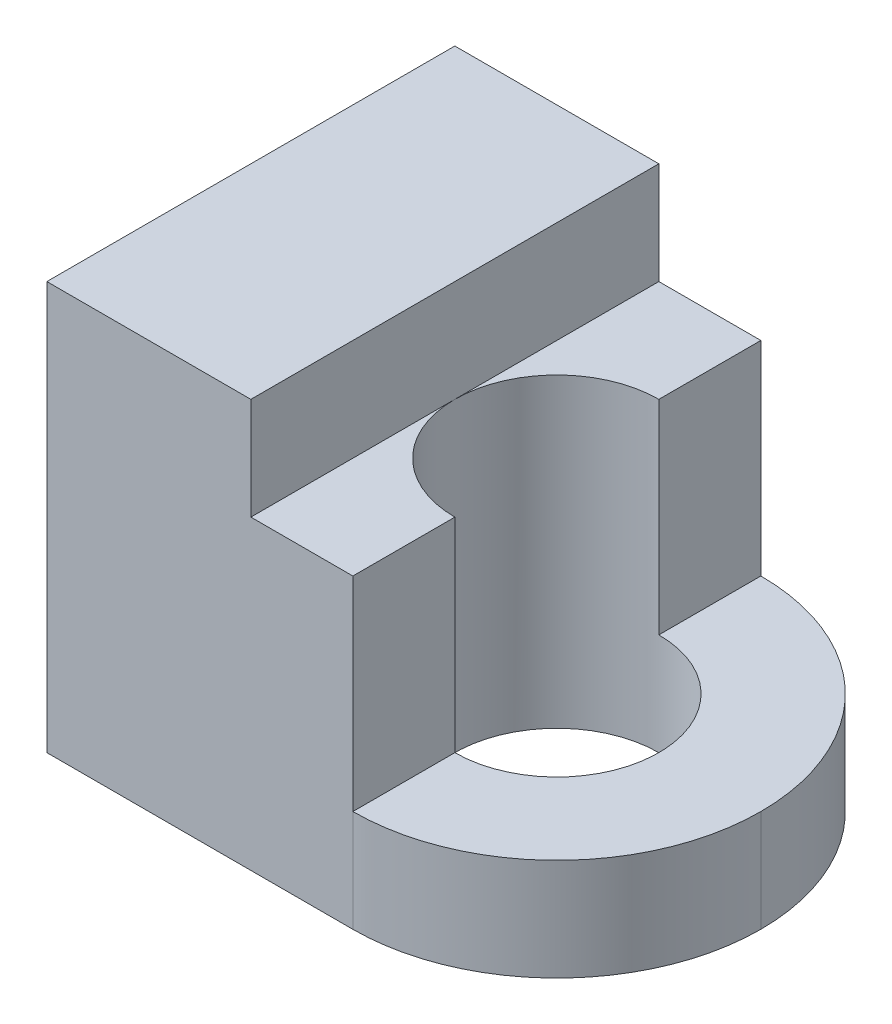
ISO-10303-21;
HEADER;
FILE_DESCRIPTION(('STEP AP214'),'2;1');
FILE_NAME('part.step','',(''),(''),'','','');
FILE_SCHEMA(('AUTOMOTIVE_DESIGN { 1 0 10303 214 1 1 1 1 }'));
ENDSEC;
DATA;
#1=APPLICATION_CONTEXT('core data for automotive mechanical design processes');
#2=APPLICATION_PROTOCOL_DEFINITION('international standard','automotive_design',2000,#1);
#3=PRODUCT_CONTEXT('',#1,'mechanical');
#4=PRODUCT('Part','Part','',(#3));
#5=PRODUCT_RELATED_PRODUCT_CATEGORY('part','',(#4));
#6=PRODUCT_DEFINITION_FORMATION('','',#4);
#7=PRODUCT_DEFINITION_CONTEXT('part definition',#1,'design');
#8=PRODUCT_DEFINITION('design','',#6,#7);
#9=PRODUCT_DEFINITION_SHAPE('','',#8);
#10=(LENGTH_UNIT() NAMED_UNIT(*) SI_UNIT(.MILLI.,.METRE.));
#11=(NAMED_UNIT(*) PLANE_ANGLE_UNIT() SI_UNIT($,.RADIAN.));
#12=(NAMED_UNIT(*) SI_UNIT($,.STERADIAN.) SOLID_ANGLE_UNIT());
#13=UNCERTAINTY_MEASURE_WITH_UNIT(LENGTH_MEASURE(1.E-05),#10,'distance_accuracy_value','');
#14=(GEOMETRIC_REPRESENTATION_CONTEXT(3) GLOBAL_UNCERTAINTY_ASSIGNED_CONTEXT((#13)) GLOBAL_UNIT_ASSIGNED_CONTEXT((#10,
#11,#12)) REPRESENTATION_CONTEXT('',''));
#15=CARTESIAN_POINT('',(0.,0.,0.));
#16=DIRECTION('',(0.,0.,1.));
#17=DIRECTION('',(1.,0.,0.));
#18=AXIS2_PLACEMENT_3D('',#15,#16,#17);
#19=CARTESIAN_POINT('',(30.,30.,0.));
#20=DIRECTION('',(1.,0.,0.));
#21=DIRECTION('',(0.,0.,-1.));
#22=AXIS2_PLACEMENT_3D('',#19,#20,#21);
#23=PLANE('',#22);
#24=DIRECTION('',(0.,-1.,0.));
#25=VECTOR('',#24,1.);
#26=CARTESIAN_POINT('',(30.,40.000025,10.));
#27=LINE('',#26,#25);
#28=CARTESIAN_POINT('',(30.,30.,10.));
#29=VERTEX_POINT('',#28);
#30=CARTESIAN_POINT('',(30.,10.,10.));
#31=VERTEX_POINT('',#30);
#32=EDGE_CURVE('E114',#29,#31,#27,.T.);
#33=ORIENTED_EDGE('',*,*,#32,.F.);
#34=DIRECTION('',(0.,0.,1.));
#35=VECTOR('',#34,1.);
#36=CARTESIAN_POINT('',(30.,30.,0.));
#37=LINE('',#36,#35);
#38=CARTESIAN_POINT('',(30.,30.,20.));
#39=VERTEX_POINT('',#38);
#40=EDGE_CURVE('E124',#29,#39,#37,.T.);
#41=ORIENTED_EDGE('',*,*,#40,.T.);
#42=DIRECTION('',(0.,-1.,0.));
#43=VECTOR('',#42,1.);
#44=CARTESIAN_POINT('',(30.,30.,20.));
#45=LINE('',#44,#43);
#46=CARTESIAN_POINT('',(30.,10.,20.));
#47=VERTEX_POINT('',#46);
#48=EDGE_CURVE('E148',#39,#47,#45,.T.);
#49=ORIENTED_EDGE('',*,*,#48,.T.);
#50=DIRECTION('',(0.,0.,1.));
#51=VECTOR('',#50,1.);
#52=CARTESIAN_POINT('',(30.,10.,0.));
#53=LINE('',#52,#51);
#54=EDGE_CURVE('E34',#31,#47,#53,.T.);
#55=ORIENTED_EDGE('',*,*,#54,.F.);
#56=EDGE_LOOP('',(#33,#41,#49,#55));
#57=FACE_BOUND('',#56,.T.);
#58=ADVANCED_FACE('F30',(#57),#23,.T.);
#59=CARTESIAN_POINT('',(-24.9460396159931,30.,0.));
#60=DIRECTION('',(0.,1.,0.));
#61=DIRECTION('',(0.,0.,1.));
#62=AXIS2_PLACEMENT_3D('',#59,#60,#61);
#63=PLANE('',#62);
#64=CARTESIAN_POINT('',(30.,30.,0.));
#65=DIRECTION('',(0.,1.,0.));
#66=DIRECTION('',(0.,0.,1.));
#67=AXIS2_PLACEMENT_3D('',#64,#65,#66);
#68=CIRCLE('',#67,10.);
#69=CARTESIAN_POINT('',(30.,30.,-10.));
#70=VERTEX_POINT('',#69);
#71=CARTESIAN_POINT('',(20.,30.,0.));
#72=VERTEX_POINT('',#71);
#73=EDGE_CURVE('E48',#70,#72,#68,.T.);
#74=ORIENTED_EDGE('',*,*,#73,.F.);
#75=CARTESIAN_POINT('',(30.,30.,-20.));
#76=VERTEX_POINT('',#75);
#77=EDGE_CURVE('E132',#76,#70,#37,.T.);
#78=ORIENTED_EDGE('',*,*,#77,.F.);
#79=DIRECTION('',(1.,0.,0.));
#80=VECTOR('',#79,1.);
#81=CARTESIAN_POINT('',(-24.9460396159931,30.,-20.));
#82=LINE('',#81,#80);
#83=CARTESIAN_POINT('',(20.,30.,-20.));
#84=VERTEX_POINT('',#83);
#85=EDGE_CURVE('E165',#84,#76,#82,.T.);
#86=ORIENTED_EDGE('',*,*,#85,.F.);
#87=DIRECTION('',(0.,0.,1.));
#88=VECTOR('',#87,1.);
#89=CARTESIAN_POINT('',(20.,30.,0.));
#90=LINE('',#89,#88);
#91=EDGE_CURVE('E136',#84,#72,#90,.T.);
#92=ORIENTED_EDGE('',*,*,#91,.T.);
#93=EDGE_LOOP('',(#74,#78,#86,#92));
#94=FACE_BOUND('',#93,.T.);
#95=ADVANCED_FACE('F225',(#94),#63,.T.);
#96=CARTESIAN_POINT('',(-24.9460396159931,10.,-20.));
#97=DIRECTION('',(0.,0.,-1.));
#98=DIRECTION('',(-1.,0.,0.));
#99=AXIS2_PLACEMENT_3D('',#96,#97,#98);
#100=PLANE('',#99);
#101=DIRECTION('',(0.,-1.,0.));
#102=VECTOR('',#101,1.);
#103=CARTESIAN_POINT('',(30.,30.,-20.));
#104=LINE('',#103,#102);
#105=CARTESIAN_POINT('',(30.,10.,-20.));
#106=VERTEX_POINT('',#105);
#107=EDGE_CURVE('E135',#76,#106,#104,.T.);
#108=ORIENTED_EDGE('',*,*,#107,.T.);
#109=DIRECTION('',(0.,-1.,0.));
#110=VECTOR('',#109,1.);
#111=CARTESIAN_POINT('',(30.,10.,-20.));
#112=LINE('',#111,#110);
#113=CARTESIAN_POINT('',(30.,0.,-20.));
#114=VERTEX_POINT('',#113);
#115=EDGE_CURVE('E158',#106,#114,#112,.T.);
#116=ORIENTED_EDGE('',*,*,#115,.T.);
#117=DIRECTION('',(1.,0.,0.));
#118=VECTOR('',#117,1.);
#119=CARTESIAN_POINT('',(-24.9460396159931,0.,-20.));
#120=LINE('',#119,#118);
#121=CARTESIAN_POINT('',(0.,0.,-20.));
#122=VERTEX_POINT('',#121);
#123=EDGE_CURVE('E149',#122,#114,#120,.T.);
#124=ORIENTED_EDGE('',*,*,#123,.F.);
#125=DIRECTION('',(0.,-1.,0.));
#126=VECTOR('',#125,1.);
#127=CARTESIAN_POINT('',(0.,40.,-20.));
#128=LINE('',#127,#126);
#129=CARTESIAN_POINT('',(0.,40.,-20.));
#130=VERTEX_POINT('',#129);
#131=EDGE_CURVE('E243',#130,#122,#128,.T.);
#132=ORIENTED_EDGE('',*,*,#131,.F.);
#133=DIRECTION('',(1.,0.,0.));
#134=VECTOR('',#133,1.);
#135=CARTESIAN_POINT('',(-24.9460396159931,40.,-20.));
#136=LINE('',#135,#134);
#137=CARTESIAN_POINT('',(20.,40.,-20.));
#138=VERTEX_POINT('',#137);
#139=EDGE_CURVE('E231',#130,#138,#136,.T.);
#140=ORIENTED_EDGE('',*,*,#139,.T.);
#141=DIRECTION('',(0.,-1.,0.));
#142=VECTOR('',#141,1.);
#143=CARTESIAN_POINT('',(20.,40.,-20.));
#144=LINE('',#143,#142);
#145=EDGE_CURVE('E168',#138,#84,#144,.T.);
#146=ORIENTED_EDGE('',*,*,#145,.T.);
#147=ORIENTED_EDGE('',*,*,#85,.T.);
#148=EDGE_LOOP('',(#108,#116,#124,#132,#140,#146,#147));
#149=FACE_BOUND('',#148,.T.);
#150=ADVANCED_FACE('F218',(#149),#100,.T.);
#151=CARTESIAN_POINT('',(-24.9460396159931,10.,20.));
#152=DIRECTION('',(0.,0.,-1.));
#153=DIRECTION('',(-1.,0.,0.));
#154=AXIS2_PLACEMENT_3D('',#151,#152,#153);
#155=PLANE('',#154);
#156=DIRECTION('',(1.,0.,0.));
#157=VECTOR('',#156,1.);
#158=CARTESIAN_POINT('',(-24.9460396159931,0.,20.));
#159=LINE('',#158,#157);
#160=CARTESIAN_POINT('',(0.,0.,20.));
#161=VERTEX_POINT('',#160);
#162=CARTESIAN_POINT('',(30.,0.,20.));
#163=VERTEX_POINT('',#162);
#164=EDGE_CURVE('E159',#161,#163,#159,.T.);
#165=ORIENTED_EDGE('',*,*,#164,.T.);
#166=DIRECTION('',(0.,-1.,0.));
#167=VECTOR('',#166,1.);
#168=CARTESIAN_POINT('',(30.,10.,20.));
#169=LINE('',#168,#167);
#170=EDGE_CURVE('E11',#163,#47,#169,.F.);
#171=ORIENTED_EDGE('',*,*,#170,.T.);
#172=ORIENTED_EDGE('',*,*,#48,.F.);
#173=DIRECTION('',(1.,0.,0.));
#174=VECTOR('',#173,1.);
#175=CARTESIAN_POINT('',(-24.9460396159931,30.,20.));
#176=LINE('',#175,#174);
#177=CARTESIAN_POINT('',(20.,30.,20.));
#178=VERTEX_POINT('',#177);
#179=EDGE_CURVE('E130',#178,#39,#176,.T.);
#180=ORIENTED_EDGE('',*,*,#179,.F.);
#181=DIRECTION('',(0.,-1.,0.));
#182=VECTOR('',#181,1.);
#183=CARTESIAN_POINT('',(20.,40.,20.));
#184=LINE('',#183,#182);
#185=CARTESIAN_POINT('',(20.,40.,20.));
#186=VERTEX_POINT('',#185);
#187=EDGE_CURVE('E193',#186,#178,#184,.T.);
#188=ORIENTED_EDGE('',*,*,#187,.F.);
#189=DIRECTION('',(1.,0.,0.));
#190=VECTOR('',#189,1.);
#191=CARTESIAN_POINT('',(-24.9460396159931,40.,20.));
#192=LINE('',#191,#190);
#193=CARTESIAN_POINT('',(0.,40.,20.));
#194=VERTEX_POINT('',#193);
#195=EDGE_CURVE('E201',#194,#186,#192,.T.);
#196=ORIENTED_EDGE('',*,*,#195,.F.);
#197=DIRECTION('',(0.,-1.,0.));
#198=VECTOR('',#197,1.);
#199=CARTESIAN_POINT('',(0.,40.,20.));
#200=LINE('',#199,#198);
#201=EDGE_CURVE('E200',#194,#161,#200,.T.);
#202=ORIENTED_EDGE('',*,*,#201,.T.);
#203=EDGE_LOOP('',(#165,#171,#172,#180,#188,#196,#202));
#204=FACE_BOUND('',#203,.T.);
#205=ADVANCED_FACE('F203',(#204),#155,.F.);
#206=CARTESIAN_POINT('',(-24.9460396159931,10.,0.));
#207=DIRECTION('',(0.,1.,0.));
#208=DIRECTION('',(0.,0.,1.));
#209=AXIS2_PLACEMENT_3D('',#206,#207,#208);
#210=PLANE('',#209);
#211=CARTESIAN_POINT('',(30.,10.,0.));
#212=DIRECTION('',(0.,1.,0.));
#213=DIRECTION('',(0.,0.,1.));
#214=AXIS2_PLACEMENT_3D('',#211,#212,#213);
#215=CIRCLE('',#214,10.);
#216=CARTESIAN_POINT('',(30.,10.,-10.));
#217=VERTEX_POINT('',#216);
#218=EDGE_CURVE('E126',#31,#217,#215,.T.);
#219=ORIENTED_EDGE('',*,*,#218,.F.);
#220=ORIENTED_EDGE('',*,*,#54,.T.);
#221=CARTESIAN_POINT('',(30.,10.,0.));
#222=DIRECTION('',(0.,1.,0.));
#223=DIRECTION('',(0.,0.,1.));
#224=AXIS2_PLACEMENT_3D('',#221,#222,#223);
#225=CIRCLE('',#224,20.);
#226=CARTESIAN_POINT('',(50.,10.,0.));
#227=VERTEX_POINT('',#226);
#228=EDGE_CURVE('E56',#47,#227,#225,.T.);
#229=ORIENTED_EDGE('',*,*,#228,.T.);
#230=CARTESIAN_POINT('',(30.,10.,0.));
#231=DIRECTION('',(0.,1.,0.));
#232=DIRECTION('',(0.,0.,1.));
#233=AXIS2_PLACEMENT_3D('',#230,#231,#232);
#234=CIRCLE('',#233,20.);
#235=EDGE_CURVE('E40',#227,#106,#234,.T.);
#236=ORIENTED_EDGE('',*,*,#235,.T.);
#237=EDGE_CURVE('E155',#106,#217,#53,.T.);
#238=ORIENTED_EDGE('',*,*,#237,.T.);
#239=EDGE_LOOP('',(#219,#220,#229,#236,#238));
#240=FACE_BOUND('',#239,.T.);
#241=ADVANCED_FACE('F212',(#240),#210,.T.);
#242=CARTESIAN_POINT('',(-24.9460396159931,0.,0.));
#243=DIRECTION('',(0.,1.,0.));
#244=DIRECTION('',(0.,0.,1.));
#245=AXIS2_PLACEMENT_3D('',#242,#243,#244);
#246=PLANE('',#245);
#247=CARTESIAN_POINT('',(30.,0.,0.));
#248=DIRECTION('',(0.,-1.,0.));
#249=DIRECTION('',(0.,0.,-1.));
#250=AXIS2_PLACEMENT_3D('',#247,#248,#249);
#251=CIRCLE('',#250,10.);
#252=CARTESIAN_POINT('',(30.,0.,-10.));
#253=VERTEX_POINT('',#252);
#254=EDGE_CURVE('E119',#253,#253,#251,.T.);
#255=ORIENTED_EDGE('',*,*,#254,.F.);
#256=EDGE_LOOP('',(#255));
#257=FACE_BOUND('',#256,.T.);
#258=ORIENTED_EDGE('',*,*,#123,.T.);
#259=CARTESIAN_POINT('',(30.,0.,0.));
#260=DIRECTION('',(0.,1.,0.));
#261=DIRECTION('',(0.,0.,1.));
#262=AXIS2_PLACEMENT_3D('',#259,#260,#261);
#263=CIRCLE('',#262,20.);
#264=CARTESIAN_POINT('',(50.,0.,0.));
#265=VERTEX_POINT('',#264);
#266=EDGE_CURVE('E177',#114,#265,#263,.F.);
#267=ORIENTED_EDGE('',*,*,#266,.T.);
#268=CARTESIAN_POINT('',(30.,0.,0.));
#269=DIRECTION('',(0.,1.,0.));
#270=DIRECTION('',(0.,0.,1.));
#271=AXIS2_PLACEMENT_3D('',#268,#269,#270);
#272=CIRCLE('',#271,20.);
#273=EDGE_CURVE('E173',#265,#163,#272,.F.);
#274=ORIENTED_EDGE('',*,*,#273,.T.);
#275=ORIENTED_EDGE('',*,*,#164,.F.);
#276=DIRECTION('',(0.,0.,1.));
#277=VECTOR('',#276,1.);
#278=CARTESIAN_POINT('',(0.,0.,0.));
#279=LINE('',#278,#277);
#280=EDGE_CURVE('E189',#122,#161,#279,.T.);
#281=ORIENTED_EDGE('',*,*,#280,.F.);
#282=EDGE_LOOP('',(#258,#267,#274,#275,#281));
#283=FACE_BOUND('',#282,.T.);
#284=ADVANCED_FACE('F254',(#257,#283),#246,.F.);
#285=DIRECTION('',(0.,-1.,0.));
#286=VECTOR('',#285,1.);
#287=CARTESIAN_POINT('',(30.,40.000025,-10.));
#288=LINE('',#287,#286);
#289=EDGE_CURVE('E216',#217,#70,#288,.F.);
#290=ORIENTED_EDGE('',*,*,#289,.F.);
#291=ORIENTED_EDGE('',*,*,#237,.F.);
#292=ORIENTED_EDGE('',*,*,#107,.F.);
#293=ORIENTED_EDGE('',*,*,#77,.T.);
#294=EDGE_LOOP('',(#290,#291,#292,#293));
#295=FACE_BOUND('',#294,.T.);
#296=ADVANCED_FACE('F215',(#295),#23,.T.);
#297=EDGE_CURVE('E110',#72,#29,#68,.T.);
#298=ORIENTED_EDGE('',*,*,#297,.F.);
#299=EDGE_CURVE('E161',#72,#178,#90,.T.);
#300=ORIENTED_EDGE('',*,*,#299,.T.);
#301=ORIENTED_EDGE('',*,*,#179,.T.);
#302=ORIENTED_EDGE('',*,*,#40,.F.);
#303=EDGE_LOOP('',(#298,#300,#301,#302));
#304=FACE_BOUND('',#303,.T.);
#305=ADVANCED_FACE('F128',(#304),#63,.T.);
#306=CARTESIAN_POINT('',(20.,40.,0.));
#307=DIRECTION('',(1.,0.,0.));
#308=DIRECTION('',(0.,0.,-1.));
#309=AXIS2_PLACEMENT_3D('',#306,#307,#308);
#310=PLANE('',#309);
#311=ORIENTED_EDGE('',*,*,#299,.F.);
#312=ORIENTED_EDGE('',*,*,#91,.F.);
#313=ORIENTED_EDGE('',*,*,#145,.F.);
#314=DIRECTION('',(0.,0.,1.));
#315=VECTOR('',#314,1.);
#316=CARTESIAN_POINT('',(20.,40.,0.));
#317=LINE('',#316,#315);
#318=EDGE_CURVE('E196',#138,#186,#317,.T.);
#319=ORIENTED_EDGE('',*,*,#318,.T.);
#320=ORIENTED_EDGE('',*,*,#187,.T.);
#321=EDGE_LOOP('',(#311,#312,#313,#319,#320));
#322=FACE_BOUND('',#321,.T.);
#323=ADVANCED_FACE('F194',(#322),#310,.T.);
#324=CARTESIAN_POINT('',(0.,40.,0.));
#325=DIRECTION('',(1.,0.,0.));
#326=DIRECTION('',(0.,0.,-1.));
#327=AXIS2_PLACEMENT_3D('',#324,#325,#326);
#328=PLANE('',#327);
#329=ORIENTED_EDGE('',*,*,#280,.T.);
#330=ORIENTED_EDGE('',*,*,#201,.F.);
#331=DIRECTION('',(0.,0.,1.));
#332=VECTOR('',#331,1.);
#333=CARTESIAN_POINT('',(0.,40.,0.));
#334=LINE('',#333,#332);
#335=EDGE_CURVE('E233',#130,#194,#334,.T.);
#336=ORIENTED_EDGE('',*,*,#335,.F.);
#337=ORIENTED_EDGE('',*,*,#131,.T.);
#338=EDGE_LOOP('',(#329,#330,#336,#337));
#339=FACE_BOUND('',#338,.T.);
#340=ADVANCED_FACE('F251',(#339),#328,.F.);
#341=CARTESIAN_POINT('',(-24.9460396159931,40.,0.));
#342=DIRECTION('',(0.,1.,0.));
#343=DIRECTION('',(0.,0.,1.));
#344=AXIS2_PLACEMENT_3D('',#341,#342,#343);
#345=PLANE('',#344);
#346=ORIENTED_EDGE('',*,*,#318,.F.);
#347=ORIENTED_EDGE('',*,*,#139,.F.);
#348=ORIENTED_EDGE('',*,*,#335,.T.);
#349=ORIENTED_EDGE('',*,*,#195,.T.);
#350=EDGE_LOOP('',(#346,#347,#348,#349));
#351=FACE_BOUND('',#350,.T.);
#352=ADVANCED_FACE('F256',(#351),#345,.T.);
#353=CARTESIAN_POINT('',(30.,10.,0.));
#354=DIRECTION('',(0.,1.,0.));
#355=DIRECTION('',(0.,0.,1.));
#356=AXIS2_PLACEMENT_3D('',#353,#354,#355);
#357=CYLINDRICAL_SURFACE('',#356,20.);
#358=DIRECTION('',(0.,-1.,0.));
#359=VECTOR('',#358,1.);
#360=CARTESIAN_POINT('',(50.,0.,0.));
#361=LINE('',#360,#359);
#362=EDGE_CURVE('E187',#227,#265,#361,.T.);
#363=ORIENTED_EDGE('',*,*,#362,.F.);
#364=ORIENTED_EDGE('',*,*,#228,.F.);
#365=ORIENTED_EDGE('',*,*,#170,.F.);
#366=ORIENTED_EDGE('',*,*,#273,.F.);
#367=EDGE_LOOP('',(#363,#364,#365,#366));
#368=FACE_BOUND('',#367,.T.);
#369=ADVANCED_FACE('F32',(#368),#357,.T.);
#370=CARTESIAN_POINT('',(30.,10.,0.));
#371=DIRECTION('',(0.,-1.,0.));
#372=DIRECTION('',(0.,0.,-1.));
#373=AXIS2_PLACEMENT_3D('',#370,#371,#372);
#374=CYLINDRICAL_SURFACE('',#373,20.);
#375=ORIENTED_EDGE('',*,*,#235,.F.);
#376=ORIENTED_EDGE('',*,*,#362,.T.);
#377=ORIENTED_EDGE('',*,*,#266,.F.);
#378=ORIENTED_EDGE('',*,*,#115,.F.);
#379=EDGE_LOOP('',(#375,#376,#377,#378));
#380=FACE_BOUND('',#379,.T.);
#381=ADVANCED_FACE('F210',(#380),#374,.T.);
#382=CARTESIAN_POINT('',(30.,40.000025,0.));
#383=DIRECTION('',(0.,-1.,0.));
#384=DIRECTION('',(0.,0.,-1.));
#385=AXIS2_PLACEMENT_3D('',#382,#383,#384);
#386=CYLINDRICAL_SURFACE('',#385,10.);
#387=ORIENTED_EDGE('',*,*,#73,.T.);
#388=ORIENTED_EDGE('',*,*,#297,.T.);
#389=ORIENTED_EDGE('',*,*,#32,.T.);
#390=ORIENTED_EDGE('',*,*,#218,.T.);
#391=ORIENTED_EDGE('',*,*,#289,.T.);
#392=EDGE_LOOP('',(#387,#388,#389,#390,#391));
#393=FACE_BOUND('',#392,.T.);
#394=ORIENTED_EDGE('',*,*,#254,.T.);
#395=EDGE_LOOP('',(#394));
#396=FACE_BOUND('',#395,.T.);
#397=ADVANCED_FACE('F112',(#393,#396),#386,.F.);
#398=CLOSED_SHELL('',(#58,#95,#150,#205,#241,#284,#296,#305,#323,#340,#352,#369,#381,#397));
#399=MANIFOLD_SOLID_BREP('B2',#398);
#400=ADVANCED_BREP_SHAPE_REPRESENTATION('',(#18,#399),#14);
#401=SHAPE_DEFINITION_REPRESENTATION(#9,#400);
ENDSEC;
END-ISO-10303-21;
